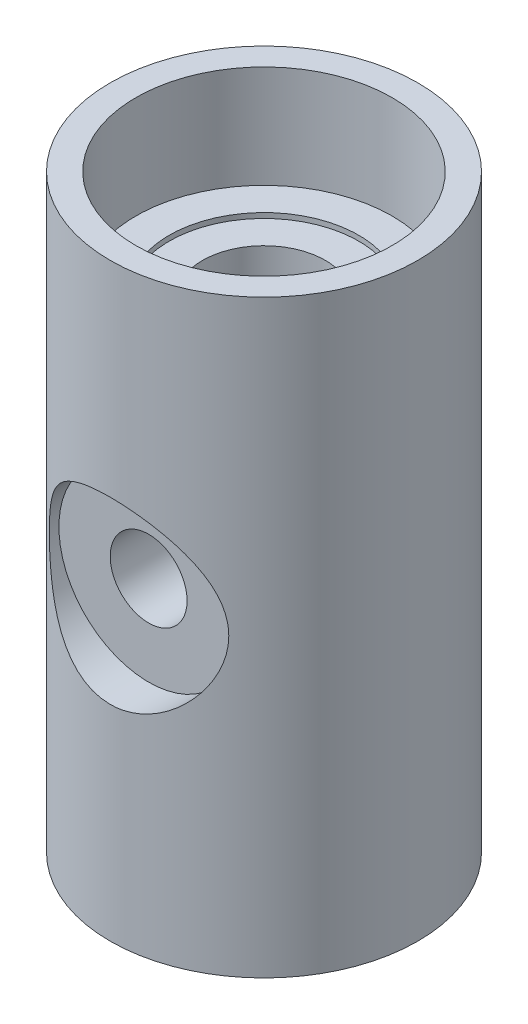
from build123d import *

# Parameters (mm, degrees)
SKETCH1_R           = 6
BOSS_EXTRUDE1_DEPTH = 11.5
SKETCH2_R           = 2.4
CUT_EXTRUDE1_DEPTH  = 25.515301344
SKETCH3_R           = 5
CUT_EXTRUDE2_DEPTH  = 4
SKETCH4_R           = 3.7
CUT_EXTRUDE3_DEPTH  = 0.2
SKETCH6_R           = 1.5
CUT_EXTRUDE4_DEPTH  = 5.2
SKETCH7_R           = 3.5
CUT_EXTRUDE5_DEPTH  = 1.5


with BuildPart() as part:
    # Sketch1 → Boss-Extrude1 (new, symmetric)
    with BuildSketch(Plane(origin=(0, 0, 0), x_dir=(1, 0, 0), z_dir=(0, 1, 0))):
        with Locations(Location((0, 0, 0), (0, 0, 270))):
            Circle(SKETCH1_R)
    extrude(amount=BOSS_EXTRUDE1_DEPTH, both=True)

    # Sketch2 → Cut-Extrude1 (cut, through all)
    with BuildSketch(Plane(origin=(0, 11.5, 0), x_dir=(1, 0, 0), z_dir=(0, 1, 0))):
        with Locations(Location((0, 0, 0), (0, 0, 270))):
            Circle(SKETCH2_R)
    extrude(amount=-CUT_EXTRUDE1_DEPTH, mode=Mode.SUBTRACT)

    # Sketch3 → Cut-Extrude2 (cut)
    with BuildSketch(Plane(origin=(0, 11.5, 0), x_dir=(1, 0, 0), z_dir=(0, 1, 0))):
        with Locations(Location((0, 0, 0), (0, 0, 270))):
            Circle(SKETCH3_R)
    cut_extrude2 = extrude(amount=-CUT_EXTRUDE2_DEPTH, mode=Mode.SUBTRACT)

    # Sketch4 → Cut-Extrude3 (cut)
    with BuildSketch(Plane(origin=(0, 7.5, 0), x_dir=(1, 0, 0), z_dir=(0, 1, 0))):
        with Locations(Location((0, 0, 0), (0, 0, 270))):
            Circle(SKETCH4_R)
    cut_extrude3 = extrude(amount=-CUT_EXTRUDE3_DEPTH, mode=Mode.SUBTRACT)

    # Mirror1: Cut-Extrude2, Cut-Extrude3 across plane
    add(cut_extrude2.mirror(Plane.ZX), mode=Mode.SUBTRACT)
    add(cut_extrude3.mirror(Plane.ZX), mode=Mode.SUBTRACT)

    # Sketch6 → Cut-Extrude4 (cut)
    with BuildSketch(Plane.XY.offset(6)):
        with Locations(Location((0, 0, 0), (0, 0, 90.000000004))):
            Circle(SKETCH6_R)
    extrude(amount=-CUT_EXTRUDE4_DEPTH, mode=Mode.SUBTRACT)

    # Sketch7 → Cut-Extrude5 (cut)
    with BuildSketch(Plane.XY.offset(6)):
        Circle(SKETCH7_R)
    extrude(amount=-CUT_EXTRUDE5_DEPTH, mode=Mode.SUBTRACT)


solid = part.part
